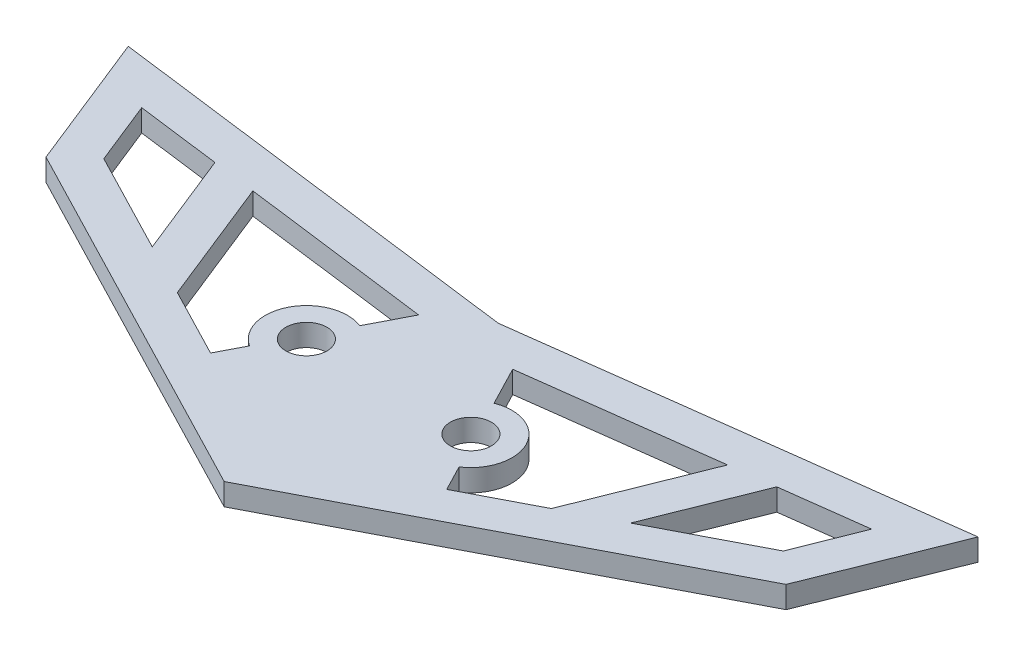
from build123d import *

# Parameters (mm, degrees)
ESQUISSE1_R      = 0.75
EXTRUSION1_DEPTH = 0.8
EXTRUSION2_DEPTH = 20.618613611


with BuildPart() as part:
    # Esquisse1 → Extrusion1 (new body)
    with BuildSketch(Plane(origin=(0, 0, 0), x_dir=(1, 0, 0), z_dir=(0, 1, 0))):
        Polygon((0, 0), (13.5, 7), (15.5, 12), (0, 10), align=None)
        with Locations(Location((3, 6, 0), (0, 0, 270))):
            Circle(ESQUISSE1_R, mode=Mode.SUBTRACT)
    extrude(amount=EXTRUSION1_DEPTH)

    # Esquisse3 → Extrusion2 (cut, through all)
    with BuildSketch(Plane(origin=(0, 0.8, 0), x_dir=(-1, 0, 0), z_dir=(0, 1, 0))):
        Polygon((-10.248475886, -9.910777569), (-13.314722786, -10.30642233), (-12.393452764, -8.003247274), (-8.724494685, -6.100824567), align=None)
        with BuildLine():
            Line((-8.658570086, -9.705628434), (-6.822071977, -5.114383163))
            Line((-6.822071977, -5.114383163), (-4.308172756, -3.810879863))
            Line((-4.308172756, -3.810879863), (-3.823244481, -4.746098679))
            ThreePointArc((-3.823244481, -4.746098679), (-4.331631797, -6.690475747), (-2.449556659, -7.395353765))
            Line((-2.449556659, -7.395353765), (-1.716125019, -8.80982907))
            Line((-1.716125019, -8.80982907), (-8.658570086, -9.705628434))
        make_face()
    extrude(amount=-EXTRUSION2_DEPTH, mode=Mode.SUBTRACT)

    # Sym_trie1: part across plane


with BuildPart() as part_1:
    add(part.part)
    add(part.part.mirror(Plane(origin=(0, 0.8, -10), x_dir=(0, 0, 1), z_dir=(1, 0, 0))))


solid = part_1.part
